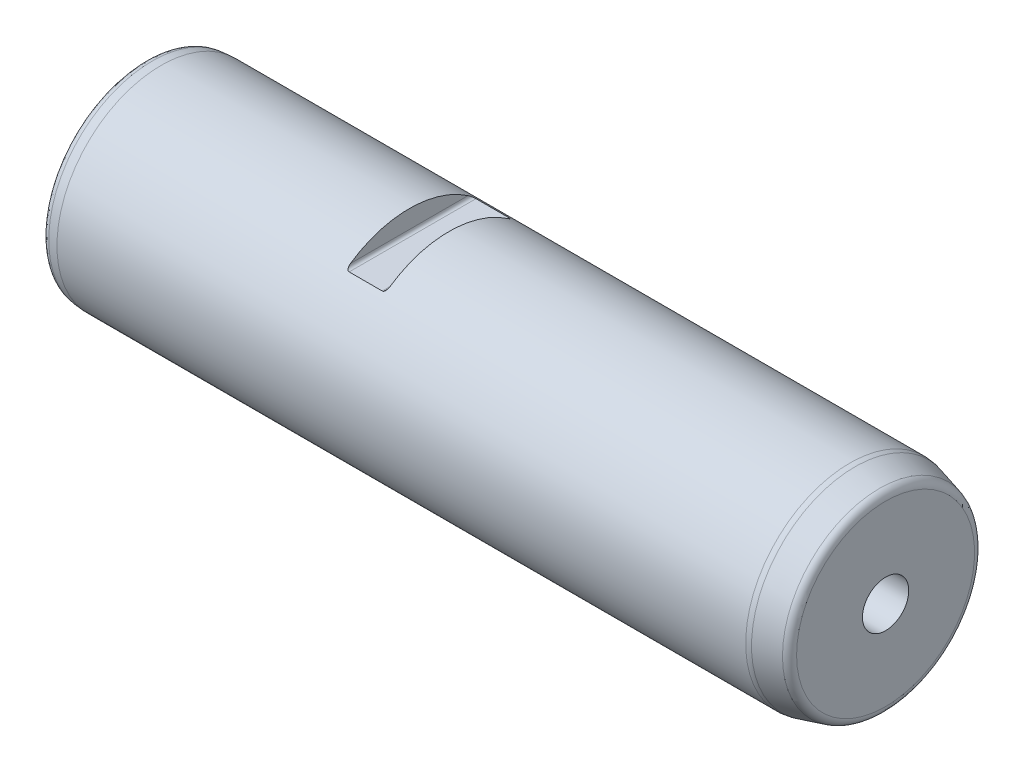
ISO-10303-21;
HEADER;
FILE_DESCRIPTION(('STEP AP214'),'2;1');
FILE_NAME('part.step','',(''),(''),'','','');
FILE_SCHEMA(('AUTOMOTIVE_DESIGN { 1 0 10303 214 1 1 1 1 }'));
ENDSEC;
DATA;
#1=APPLICATION_CONTEXT('core data for automotive mechanical design processes');
#2=APPLICATION_PROTOCOL_DEFINITION('international standard','automotive_design',2000,#1);
#3=PRODUCT_CONTEXT('',#1,'mechanical');
#4=PRODUCT('Part','Part','',(#3));
#5=PRODUCT_RELATED_PRODUCT_CATEGORY('part','',(#4));
#6=PRODUCT_DEFINITION_FORMATION('','',#4);
#7=PRODUCT_DEFINITION_CONTEXT('part definition',#1,'design');
#8=PRODUCT_DEFINITION('design','',#6,#7);
#9=PRODUCT_DEFINITION_SHAPE('','',#8);
#10=(LENGTH_UNIT() NAMED_UNIT(*) SI_UNIT(.MILLI.,.METRE.));
#11=(NAMED_UNIT(*) PLANE_ANGLE_UNIT() SI_UNIT($,.RADIAN.));
#12=(NAMED_UNIT(*) SI_UNIT($,.STERADIAN.) SOLID_ANGLE_UNIT());
#13=UNCERTAINTY_MEASURE_WITH_UNIT(LENGTH_MEASURE(1.E-05),#10,'distance_accuracy_value','');
#14=(GEOMETRIC_REPRESENTATION_CONTEXT(3) GLOBAL_UNCERTAINTY_ASSIGNED_CONTEXT((#13)) GLOBAL_UNIT_ASSIGNED_CONTEXT((#10,
#11,#12)) REPRESENTATION_CONTEXT('',''));
#15=CARTESIAN_POINT('',(0.,0.,0.));
#16=DIRECTION('',(0.,0.,1.));
#17=DIRECTION('',(1.,0.,0.));
#18=AXIS2_PLACEMENT_3D('',#15,#16,#17);
#19=CARTESIAN_POINT('',(0.,0.,0.));
#20=DIRECTION('',(1.,0.,0.));
#21=DIRECTION('',(0.,0.,-1.));
#22=AXIS2_PLACEMENT_3D('',#19,#20,#21);
#23=PLANE('',#22);
#24=CARTESIAN_POINT('',(0.,0.,0.));
#25=DIRECTION('',(1.,0.,0.));
#26=DIRECTION('',(0.,0.,-1.));
#27=AXIS2_PLACEMENT_3D('',#24,#25,#26);
#28=CIRCLE('',#27,28.771728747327);
#29=CARTESIAN_POINT('',(0.,0.,-28.771728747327));
#30=VERTEX_POINT('',#29);
#31=EDGE_CURVE('E160',#30,#30,#28,.F.);
#32=ORIENTED_EDGE('',*,*,#31,.T.);
#33=EDGE_LOOP('',(#32));
#34=FACE_BOUND('',#33,.T.);
#35=ADVANCED_FACE('F15',(#34),#23,.F.);
#36=CARTESIAN_POINT('',(0.,0.,0.));
#37=DIRECTION('',(-1.,0.,0.));
#38=DIRECTION('',(0.,0.,1.));
#39=AXIS2_PLACEMENT_3D('',#36,#37,#38);
#40=CYLINDRICAL_SURFACE('',#39,31.5);
#41=CARTESIAN_POINT('',(91.,25.,-19.1637678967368));
#42=CARTESIAN_POINT('',(91.0206021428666,24.9999962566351,-19.1637724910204));
#43=CARTESIAN_POINT('',(91.0411895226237,25.000637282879,-19.1629365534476));
#44=CARTESIAN_POINT('',(91.0821323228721,25.0031684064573,-19.1596340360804));
#45=CARTESIAN_POINT('',(91.1024879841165,25.0050570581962,-19.1571693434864));
#46=CARTESIAN_POINT('',(91.1624864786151,25.0124756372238,-19.1474836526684));
#47=CARTESIAN_POINT('',(91.2015690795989,25.0197603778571,-19.1379682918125));
#48=CARTESIAN_POINT('',(91.2768030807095,25.0382921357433,-19.1137163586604));
#49=CARTESIAN_POINT('',(91.3129662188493,25.0495222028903,-19.0990021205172));
#50=CARTESIAN_POINT('',(91.3821411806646,25.0751576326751,-19.0653329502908));
#51=CARTESIAN_POINT('',(91.4151429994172,25.0895726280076,-19.0463651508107));
#52=CARTESIAN_POINT('',(91.4940924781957,25.1289598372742,-18.9943915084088));
#53=CARTESIAN_POINT('',(91.5378167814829,25.1555174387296,-18.9592231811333));
#54=CARTESIAN_POINT('',(91.6178752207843,25.2121909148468,-18.8837940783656));
#55=CARTESIAN_POINT('',(91.654194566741,25.2423137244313,-18.8435233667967));
#56=CARTESIAN_POINT('',(91.7400427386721,25.323512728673,-18.7343708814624));
#57=CARTESIAN_POINT('',(91.7844613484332,25.3763362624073,-18.6627946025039));
#58=CARTESIAN_POINT('',(91.8595737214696,25.4847393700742,-18.5144966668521));
#59=CARTESIAN_POINT('',(91.8902090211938,25.5403295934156,-18.4377546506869));
#60=CARTESIAN_POINT('',(91.9297784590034,25.6300581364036,-18.3126586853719));
#61=CARTESIAN_POINT('',(91.9424916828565,25.6638849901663,-18.2652250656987));
#62=CARTESIAN_POINT('',(91.9639933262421,25.7317021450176,-18.1695608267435));
#63=CARTESIAN_POINT('',(91.9727802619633,25.7656925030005,-18.121329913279));
#64=CARTESIAN_POINT('',(91.9865826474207,25.8331875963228,-18.0249779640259));
#65=CARTESIAN_POINT('',(91.9916469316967,25.8666927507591,-17.9768640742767));
#66=CARTESIAN_POINT('',(91.9983485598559,25.9335124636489,-17.8803351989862));
#67=CARTESIAN_POINT('',(91.9999892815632,25.9668271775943,-17.8319205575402));
#68=CARTESIAN_POINT('',(92.,26.,-17.7834192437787));
#69=B_SPLINE_CURVE_WITH_KNOTS('',3,(#41,#42,#43,#44,#45,#46,#47,#48,#49,#50,#51,#52,#53,#54,#55,
#56,#57,#58,#59,#60,#61,#62,#63,#64,#65,#66,#67,#68),.UNSPECIFIED.,.F.,.F.,(4,2,2,2,2,2,2,2,2,2,
2,2,2,4),(0.,0.061752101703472,0.123432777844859,0.245296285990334,0.366642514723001,
0.488360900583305,0.673551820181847,0.859109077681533,1.1557616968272,1.45366100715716,
1.63242917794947,1.81126485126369,1.9877104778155,2.16398193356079),.UNSPECIFIED.);
#70=CARTESIAN_POINT('',(91.,25.,-19.1637678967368));
#71=VERTEX_POINT('',#70);
#72=CARTESIAN_POINT('',(92.,26.,-17.7834192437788));
#73=VERTEX_POINT('',#72);
#74=EDGE_CURVE('E206',#71,#73,#69,.T.);
#75=ORIENTED_EDGE('',*,*,#74,.T.);
#76=CARTESIAN_POINT('',(92.,0.,0.));
#77=DIRECTION('',(1.,0.,0.));
#78=DIRECTION('',(0.,0.,-1.));
#79=AXIS2_PLACEMENT_3D('',#76,#77,#78);
#80=CIRCLE('',#79,31.5);
#81=CARTESIAN_POINT('',(92.,26.,17.7834192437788));
#82=VERTEX_POINT('',#81);
#83=EDGE_CURVE('E9',#73,#82,#80,.T.);
#84=ORIENTED_EDGE('',*,*,#83,.T.);
#85=CARTESIAN_POINT('',(92.,26.,17.7834192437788));
#86=CARTESIAN_POINT('',(91.9999572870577,25.9536837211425,17.8511416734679));
#87=CARTESIAN_POINT('',(91.9967773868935,25.9070697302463,17.9187190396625));
#88=CARTESIAN_POINT('',(91.98359435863,25.8134163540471,18.0533717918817));
#89=CARTESIAN_POINT('',(91.9735592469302,25.7663759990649,18.1204433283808));
#90=CARTESIAN_POINT('',(91.9459716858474,25.672018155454,18.2538828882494));
#91=CARTESIAN_POINT('',(91.9283458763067,25.6247025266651,18.3202373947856));
#92=CARTESIAN_POINT('',(91.8846961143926,25.5309760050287,18.450628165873));
#93=CARTESIAN_POINT('',(91.8586908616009,25.4845633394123,18.5146692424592));
#94=CARTESIAN_POINT('',(91.8035708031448,25.4032208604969,18.6260588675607));
#95=CARTESIAN_POINT('',(91.7762945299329,25.3679487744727,18.6740601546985));
#96=CARTESIAN_POINT('',(91.7149053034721,25.2992635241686,18.7670081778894));
#97=CARTESIAN_POINT('',(91.6807928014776,25.2658502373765,18.8119551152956));
#98=CARTESIAN_POINT('',(91.6042482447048,25.2016125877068,18.8979268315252));
#99=CARTESIAN_POINT('',(91.5617053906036,25.1708315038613,18.9388871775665));
#100=CARTESIAN_POINT('',(91.4677411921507,25.1144557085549,19.0135816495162));
#101=CARTESIAN_POINT('',(91.4163575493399,25.0888399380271,19.0473451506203));
#102=CARTESIAN_POINT('',(91.3286773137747,25.0549354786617,19.0918997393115));
#103=CARTESIAN_POINT('',(91.2952896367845,25.0439158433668,19.106347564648));
#104=CARTESIAN_POINT('',(91.2260723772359,25.0252341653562,19.1308099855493));
#105=CARTESIAN_POINT('',(91.1902489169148,25.0175640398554,19.1408352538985));
#106=CARTESIAN_POINT('',(91.1285741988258,25.0079765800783,19.1533587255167));
#107=CARTESIAN_POINT('',(91.1031595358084,25.0050065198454,19.1572353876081));
#108=CARTESIAN_POINT('',(91.0518392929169,25.001008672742,19.1624520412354));
#109=CARTESIAN_POINT('',(91.0259323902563,24.9999872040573,19.1637837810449));
#110=CARTESIAN_POINT('',(91.,25.,19.1637678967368));
#111=B_SPLINE_CURVE_WITH_KNOTS('',3,(#85,#86,#87,#88,#89,#90,#91,#92,#93,#94,#95,#96,#97,#98,
#99,#100,#101,#102,#103,#104,#105,#106,#107,#108,#109,#110),.UNSPECIFIED.,.F.,.F.,(4,2,2,2,2,2,
2,2,2,2,2,2,4),(0.,0.246152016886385,0.493460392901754,0.743214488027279,0.992415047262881,
1.18859975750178,1.38477152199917,1.58371665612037,1.78183351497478,1.89547599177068,
2.00884269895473,2.08629068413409,2.16398936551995),.UNSPECIFIED.);
#112=CARTESIAN_POINT('',(91.,25.,19.1637678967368));
#113=VERTEX_POINT('',#112);
#114=EDGE_CURVE('E23',#82,#113,#111,.T.);
#115=ORIENTED_EDGE('',*,*,#114,.T.);
#116=DIRECTION('',(-1.,0.,0.));
#117=VECTOR('',#116,1.);
#118=CARTESIAN_POINT('',(0.,25.,19.1637678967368));
#119=LINE('',#118,#117);
#120=CARTESIAN_POINT('',(81.,25.,19.1637678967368));
#121=VERTEX_POINT('',#120);
#122=EDGE_CURVE('E74',#113,#121,#119,.T.);
#123=ORIENTED_EDGE('',*,*,#122,.T.);
#124=CARTESIAN_POINT('',(81.,25.,19.1637678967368));
#125=CARTESIAN_POINT('',(80.9793978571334,24.9999962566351,19.1637724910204));
#126=CARTESIAN_POINT('',(80.9588104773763,25.000637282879,19.1629365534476));
#127=CARTESIAN_POINT('',(80.9178676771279,25.0031684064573,19.1596340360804));
#128=CARTESIAN_POINT('',(80.8975120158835,25.0050570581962,19.1571693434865));
#129=CARTESIAN_POINT('',(80.8375135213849,25.0124756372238,19.1474836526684));
#130=CARTESIAN_POINT('',(80.7984309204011,25.0197603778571,19.1379682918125));
#131=CARTESIAN_POINT('',(80.7231969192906,25.0382921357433,19.1137163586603));
#132=CARTESIAN_POINT('',(80.6870337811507,25.0495222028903,19.0990021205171));
#133=CARTESIAN_POINT('',(80.6178588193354,25.0751576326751,19.0653329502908));
#134=CARTESIAN_POINT('',(80.5848570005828,25.0895726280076,19.0463651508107));
#135=CARTESIAN_POINT('',(80.5059075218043,25.1289598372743,18.9943915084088));
#136=CARTESIAN_POINT('',(80.4621832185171,25.1555174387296,18.9592231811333));
#137=CARTESIAN_POINT('',(80.3821247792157,25.2121909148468,18.8837940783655));
#138=CARTESIAN_POINT('',(80.345805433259,25.2423137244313,18.8435233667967));
#139=CARTESIAN_POINT('',(80.2599572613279,25.3235127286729,18.7343708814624));
#140=CARTESIAN_POINT('',(80.2155386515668,25.3763362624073,18.662794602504));
#141=CARTESIAN_POINT('',(80.1404262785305,25.4847393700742,18.5144966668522));
#142=CARTESIAN_POINT('',(80.1097909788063,25.5403295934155,18.437754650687));
#143=CARTESIAN_POINT('',(80.0702215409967,25.6300581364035,18.3126586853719));
#144=CARTESIAN_POINT('',(80.0575083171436,25.6638849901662,18.2652250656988));
#145=CARTESIAN_POINT('',(80.0360066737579,25.7317021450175,18.1695608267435));
#146=CARTESIAN_POINT('',(80.0272197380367,25.7656925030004,18.121329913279));
#147=CARTESIAN_POINT('',(80.0134173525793,25.8331875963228,18.0249779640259));
#148=CARTESIAN_POINT('',(80.0083530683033,25.866692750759,17.9768640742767));
#149=CARTESIAN_POINT('',(80.0016514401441,25.9335124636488,17.8803351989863));
#150=CARTESIAN_POINT('',(80.0000107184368,25.9668271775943,17.8319205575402));
#151=CARTESIAN_POINT('',(80.,26.,17.7834192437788));
#152=B_SPLINE_CURVE_WITH_KNOTS('',3,(#124,#125,#126,#127,#128,#129,#130,#131,#132,#133,#134,
#135,#136,#137,#138,#139,#140,#141,#142,#143,#144,#145,#146,#147,#148,#149,#150,#151),
.UNSPECIFIED.,.F.,.F.,(4,2,2,2,2,2,2,2,2,2,2,2,2,4),(0.,0.0617521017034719,0.123432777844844,
0.245296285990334,0.366642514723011,0.488360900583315,0.673551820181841,0.859109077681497,
1.15576169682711,1.45366100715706,1.63242917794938,1.81126485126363,1.98771047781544,
2.16398193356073),.UNSPECIFIED.);
#153=CARTESIAN_POINT('',(80.,26.,17.7834192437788));
#154=VERTEX_POINT('',#153);
#155=EDGE_CURVE('E65',#121,#154,#152,.T.);
#156=ORIENTED_EDGE('',*,*,#155,.T.);
#157=CARTESIAN_POINT('',(80.,0.,0.));
#158=DIRECTION('',(-1.,0.,0.));
#159=DIRECTION('',(0.,-1.,0.));
#160=AXIS2_PLACEMENT_3D('',#157,#158,#159);
#161=CIRCLE('',#160,31.5);
#162=CARTESIAN_POINT('',(80.,26.,-17.7834192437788));
#163=VERTEX_POINT('',#162);
#164=EDGE_CURVE('E54',#154,#163,#161,.T.);
#165=ORIENTED_EDGE('',*,*,#164,.T.);
#166=CARTESIAN_POINT('',(80.,26.,-17.7834192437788));
#167=CARTESIAN_POINT('',(80.0000427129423,25.9536837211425,-17.8511416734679));
#168=CARTESIAN_POINT('',(80.0032226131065,25.9070697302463,-17.9187190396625));
#169=CARTESIAN_POINT('',(80.01640564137,25.8134163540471,-18.0533717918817));
#170=CARTESIAN_POINT('',(80.0264407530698,25.7663759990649,-18.1204433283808));
#171=CARTESIAN_POINT('',(80.0540283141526,25.672018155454,-18.2538828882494));
#172=CARTESIAN_POINT('',(80.0716541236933,25.6247025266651,-18.3202373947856));
#173=CARTESIAN_POINT('',(80.1153038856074,25.5309760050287,-18.450628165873));
#174=CARTESIAN_POINT('',(80.1413091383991,25.4845633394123,-18.5146692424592));
#175=CARTESIAN_POINT('',(80.1964291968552,25.4032208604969,-18.6260588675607));
#176=CARTESIAN_POINT('',(80.2237054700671,25.3679487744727,-18.6740601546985));
#177=CARTESIAN_POINT('',(80.2850946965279,25.2992635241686,-18.7670081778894));
#178=CARTESIAN_POINT('',(80.3192071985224,25.2658502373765,-18.8119551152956));
#179=CARTESIAN_POINT('',(80.3957517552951,25.2016125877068,-18.8979268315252));
#180=CARTESIAN_POINT('',(80.4382946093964,25.1708315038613,-18.9388871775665));
#181=CARTESIAN_POINT('',(80.5322588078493,25.1144557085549,-19.0135816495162));
#182=CARTESIAN_POINT('',(80.5836424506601,25.0888399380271,-19.0473451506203));
#183=CARTESIAN_POINT('',(80.6713226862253,25.0549354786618,-19.0918997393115));
#184=CARTESIAN_POINT('',(80.7047103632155,25.0439158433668,-19.106347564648));
#185=CARTESIAN_POINT('',(80.7739276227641,25.0252341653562,-19.1308099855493));
#186=CARTESIAN_POINT('',(80.8097510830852,25.0175640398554,-19.1408352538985));
#187=CARTESIAN_POINT('',(80.8714258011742,25.0079765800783,-19.1533587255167));
#188=CARTESIAN_POINT('',(80.8968404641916,25.0050065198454,-19.1572353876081));
#189=CARTESIAN_POINT('',(80.9481607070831,25.001008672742,-19.1624520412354));
#190=CARTESIAN_POINT('',(80.9740676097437,24.9999872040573,-19.1637837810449));
#191=CARTESIAN_POINT('',(81.,25.,-19.1637678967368));
#192=B_SPLINE_CURVE_WITH_KNOTS('',3,(#166,#167,#168,#169,#170,#171,#172,#173,#174,#175,#176,
#177,#178,#179,#180,#181,#182,#183,#184,#185,#186,#187,#188,#189,#190,#191),.UNSPECIFIED.,.F.,
.F.,(4,2,2,2,2,2,2,2,2,2,2,2,4),(0.,0.246152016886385,0.493460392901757,0.743214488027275,
0.992415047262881,1.18859975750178,1.38477152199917,1.58371665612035,1.78183351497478,
1.89547599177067,2.00884269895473,2.08629068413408,2.16398936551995),.UNSPECIFIED.);
#193=CARTESIAN_POINT('',(81.,25.,-19.1637678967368));
#194=VERTEX_POINT('',#193);
#195=EDGE_CURVE('E59',#163,#194,#192,.T.);
#196=ORIENTED_EDGE('',*,*,#195,.T.);
#197=DIRECTION('',(-1.,0.,0.));
#198=VECTOR('',#197,1.);
#199=CARTESIAN_POINT('',(0.,25.,-19.1637678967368));
#200=LINE('',#199,#198);
#201=EDGE_CURVE('E75',#194,#71,#200,.F.);
#202=ORIENTED_EDGE('',*,*,#201,.T.);
#203=EDGE_LOOP('',(#75,#84,#115,#123,#156,#165,#196,#202));
#204=FACE_BOUND('',#203,.T.);
#205=CARTESIAN_POINT('',(4.99999999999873,0.,0.));
#206=DIRECTION('',(1.,0.,0.));
#207=DIRECTION('',(0.,0.,-1.));
#208=AXIS2_PLACEMENT_3D('',#205,#206,#207);
#209=CIRCLE('',#208,31.5);
#210=CARTESIAN_POINT('',(4.99999999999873,0.,-31.5));
#211=VERTEX_POINT('',#210);
#212=EDGE_CURVE('E159',#211,#211,#209,.T.);
#213=ORIENTED_EDGE('',*,*,#212,.T.);
#214=EDGE_LOOP('',(#213));
#215=FACE_BOUND('',#214,.T.);
#216=CARTESIAN_POINT('',(213.210085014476,0.,0.));
#217=DIRECTION('',(1.,0.,0.));
#218=DIRECTION('',(0.,0.,-1.));
#219=AXIS2_PLACEMENT_3D('',#216,#217,#218);
#220=CIRCLE('',#219,31.5);
#221=CARTESIAN_POINT('',(213.210085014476,0.,-31.5));
#222=VERTEX_POINT('',#221);
#223=EDGE_CURVE('E177',#222,#222,#220,.F.);
#224=ORIENTED_EDGE('',*,*,#223,.T.);
#225=EDGE_LOOP('',(#224));
#226=FACE_BOUND('',#225,.T.);
#227=ADVANCED_FACE('F71',(#204,#215,#226),#40,.T.);
#228=CARTESIAN_POINT('',(224.,0.,0.));
#229=DIRECTION('',(-1.,0.,0.));
#230=DIRECTION('',(0.,0.,1.));
#231=AXIS2_PLACEMENT_3D('',#228,#229,#230);
#232=CONICAL_SURFACE('',#231,28.8205080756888,0.26179938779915);
#233=CARTESIAN_POINT('',(222.147047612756,0.,0.));
#234=DIRECTION('',(1.,0.,0.));
#235=DIRECTION('',(0.,0.,-1.));
#236=AXIS2_PLACEMENT_3D('',#233,#234,#235);
#237=CIRCLE('',#236,29.317005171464);
#238=CARTESIAN_POINT('',(222.147047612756,0.,-29.317005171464));
#239=VERTEX_POINT('',#238);
#240=EDGE_CURVE('E165',#239,#239,#237,.F.);
#241=ORIENTED_EDGE('',*,*,#240,.T.);
#242=EDGE_LOOP('',(#241));
#243=FACE_BOUND('',#242,.T.);
#244=CARTESIAN_POINT('',(214.762999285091,0.,0.));
#245=DIRECTION('',(1.,0.,0.));
#246=DIRECTION('',(0.,0.,-1.));
#247=AXIS2_PLACEMENT_3D('',#244,#245,#246);
#248=CIRCLE('',#247,31.2955549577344);
#249=CARTESIAN_POINT('',(214.762999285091,0.,-31.2955549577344));
#250=VERTEX_POINT('',#249);
#251=EDGE_CURVE('E190',#250,#250,#248,.T.);
#252=ORIENTED_EDGE('',*,*,#251,.T.);
#253=EDGE_LOOP('',(#252));
#254=FACE_BOUND('',#253,.T.);
#255=ADVANCED_FACE('F122',(#243,#254),#232,.T.);
#256=CARTESIAN_POINT('',(224.,28.8205080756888,0.));
#257=DIRECTION('',(-1.,0.,0.));
#258=DIRECTION('',(0.,0.,1.));
#259=AXIS2_PLACEMENT_3D('',#256,#257,#258);
#260=PLANE('',#259);
#261=CARTESIAN_POINT('',(224.,0.,0.));
#262=DIRECTION('',(1.,0.,0.));
#263=DIRECTION('',(0.,0.,-1.));
#264=AXIS2_PLACEMENT_3D('',#261,#262,#263);
#265=CIRCLE('',#264,7.);
#266=CARTESIAN_POINT('',(224.,0.,-7.));
#267=VERTEX_POINT('',#266);
#268=EDGE_CURVE('E180',#267,#267,#265,.T.);
#269=ORIENTED_EDGE('',*,*,#268,.F.);
#270=EDGE_LOOP('',(#269));
#271=FACE_BOUND('',#270,.T.);
#272=CARTESIAN_POINT('',(224.,0.,0.));
#273=DIRECTION('',(-1.,0.,0.));
#274=DIRECTION('',(0.,0.,1.));
#275=AXIS2_PLACEMENT_3D('',#272,#273,#274);
#276=CIRCLE('',#275,26.9021906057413);
#277=CARTESIAN_POINT('',(224.,0.,26.9021906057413));
#278=VERTEX_POINT('',#277);
#279=EDGE_CURVE('E161',#278,#278,#276,.F.);
#280=ORIENTED_EDGE('',*,*,#279,.T.);
#281=EDGE_LOOP('',(#280));
#282=FACE_BOUND('',#281,.T.);
#283=ADVANCED_FACE('F119',(#271,#282),#260,.F.);
#284=CARTESIAN_POINT('',(213.210085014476,0.,0.));
#285=DIRECTION('',(1.,0.,0.));
#286=DIRECTION('',(0.,0.,-1.));
#287=AXIS2_PLACEMENT_3D('',#284,#285,#286);
#288=TOROIDAL_SURFACE('',#287,25.5,6.);
#289=ORIENTED_EDGE('',*,*,#251,.F.);
#290=EDGE_LOOP('',(#289));
#291=FACE_BOUND('',#290,.T.);
#292=ORIENTED_EDGE('',*,*,#223,.F.);
#293=EDGE_LOOP('',(#292));
#294=FACE_BOUND('',#293,.T.);
#295=ADVANCED_FACE('F121',(#291,#294),#288,.T.);
#296=CARTESIAN_POINT('',(221.5,0.,0.));
#297=DIRECTION('',(-1.,0.,0.));
#298=DIRECTION('',(0.,0.,1.));
#299=AXIS2_PLACEMENT_3D('',#296,#297,#298);
#300=TOROIDAL_SURFACE('',#299,26.9021906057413,2.5);
#301=ORIENTED_EDGE('',*,*,#279,.F.);
#302=EDGE_LOOP('',(#301));
#303=FACE_BOUND('',#302,.T.);
#304=ORIENTED_EDGE('',*,*,#240,.F.);
#305=EDGE_LOOP('',(#304));
#306=FACE_BOUND('',#305,.T.);
#307=ADVANCED_FACE('F142',(#303,#306),#300,.T.);
#308=CARTESIAN_POINT('',(0.,0.,0.));
#309=DIRECTION('',(1.,0.,0.));
#310=DIRECTION('',(0.,0.,-1.));
#311=AXIS2_PLACEMENT_3D('',#308,#309,#310);
#312=CONICAL_SURFACE('',#311,31.0625566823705,0.0872664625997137);
#313=CARTESIAN_POINT('',(2.28211064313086,0.,0.));
#314=DIRECTION('',(1.,0.,0.));
#315=DIRECTION('',(0.,0.,-1.));
#316=AXIS2_PLACEMENT_3D('',#313,#314,#315);
#317=CIRCLE('',#316,31.2622154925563);
#318=CARTESIAN_POINT('',(2.28211064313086,0.,-31.2622154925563));
#319=VERTEX_POINT('',#318);
#320=EDGE_CURVE('E60',#319,#319,#317,.T.);
#321=ORIENTED_EDGE('',*,*,#320,.T.);
#322=EDGE_LOOP('',(#321));
#323=FACE_BOUND('',#322,.T.);
#324=ORIENTED_EDGE('',*,*,#212,.F.);
#325=EDGE_LOOP('',(#324));
#326=FACE_BOUND('',#325,.T.);
#327=ADVANCED_FACE('F145',(#323,#326),#312,.T.);
#328=CARTESIAN_POINT('',(2.5,0.,0.));
#329=DIRECTION('',(1.,0.,0.));
#330=DIRECTION('',(0.,0.,-1.));
#331=AXIS2_PLACEMENT_3D('',#328,#329,#330);
#332=TOROIDAL_SURFACE('',#331,28.771728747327,2.5);
#333=ORIENTED_EDGE('',*,*,#320,.F.);
#334=EDGE_LOOP('',(#333));
#335=FACE_BOUND('',#334,.T.);
#336=ORIENTED_EDGE('',*,*,#31,.F.);
#337=EDGE_LOOP('',(#336));
#338=FACE_BOUND('',#337,.T.);
#339=ADVANCED_FACE('F17',(#335,#338),#332,.T.);
#340=CARTESIAN_POINT('',(200.,0.,0.));
#341=DIRECTION('',(1.,0.,0.));
#342=DIRECTION('',(0.,0.,-1.));
#343=AXIS2_PLACEMENT_3D('',#340,#341,#342);
#344=PLANE('',#343);
#345=CARTESIAN_POINT('',(200.,0.,0.));
#346=DIRECTION('',(1.,0.,0.));
#347=DIRECTION('',(0.,0.,-1.));
#348=AXIS2_PLACEMENT_3D('',#345,#346,#347);
#349=CIRCLE('',#348,7.);
#350=CARTESIAN_POINT('',(200.,0.,-7.));
#351=VERTEX_POINT('',#350);
#352=EDGE_CURVE('E173',#351,#351,#349,.T.);
#353=ORIENTED_EDGE('',*,*,#352,.T.);
#354=EDGE_LOOP('',(#353));
#355=FACE_BOUND('',#354,.T.);
#356=CARTESIAN_POINT('',(200.,0.,0.));
#357=DIRECTION('',(1.,0.,0.));
#358=DIRECTION('',(0.,0.,-1.));
#359=AXIS2_PLACEMENT_3D('',#356,#357,#358);
#360=CIRCLE('',#359,5.1);
#361=CARTESIAN_POINT('',(200.,0.,-5.1));
#362=VERTEX_POINT('',#361);
#363=EDGE_CURVE('E170',#362,#362,#360,.F.);
#364=ORIENTED_EDGE('',*,*,#363,.T.);
#365=EDGE_LOOP('',(#364));
#366=FACE_BOUND('',#365,.T.);
#367=ADVANCED_FACE('F103',(#355,#366),#344,.T.);
#368=CARTESIAN_POINT('',(200.,0.,0.));
#369=DIRECTION('',(1.,0.,0.));
#370=DIRECTION('',(0.,0.,-1.));
#371=AXIS2_PLACEMENT_3D('',#368,#369,#370);
#372=CYLINDRICAL_SURFACE('',#371,7.);
#373=ORIENTED_EDGE('',*,*,#352,.F.);
#374=EDGE_LOOP('',(#373));
#375=FACE_BOUND('',#374,.T.);
#376=ORIENTED_EDGE('',*,*,#268,.T.);
#377=EDGE_LOOP('',(#376));
#378=FACE_BOUND('',#377,.T.);
#379=ADVANCED_FACE('F106',(#375,#378),#372,.F.);
#380=CARTESIAN_POINT('',(194.,0.,0.));
#381=DIRECTION('',(1.,0.,0.));
#382=DIRECTION('',(0.,0.,-1.));
#383=AXIS2_PLACEMENT_3D('',#380,#381,#382);
#384=CONICAL_SURFACE('',#383,5.1,1.0471975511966);
#385=CARTESIAN_POINT('',(191.055513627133,0.,0.));
#386=VERTEX_POINT('',#385);
#387=VERTEX_LOOP('',#386);
#388=FACE_BOUND('',#387,.T.);
#389=CARTESIAN_POINT('',(194.,0.,0.));
#390=DIRECTION('',(1.,0.,0.));
#391=DIRECTION('',(0.,0.,-1.));
#392=AXIS2_PLACEMENT_3D('',#389,#390,#391);
#393=CIRCLE('',#392,5.1);
#394=CARTESIAN_POINT('',(194.,0.,-5.1));
#395=VERTEX_POINT('',#394);
#396=EDGE_CURVE('E172',#395,#395,#393,.T.);
#397=ORIENTED_EDGE('',*,*,#396,.T.);
#398=EDGE_LOOP('',(#397));
#399=FACE_BOUND('',#398,.T.);
#400=ADVANCED_FACE('F110',(#388,#399),#384,.F.);
#401=CARTESIAN_POINT('',(224.,0.,0.));
#402=DIRECTION('',(1.,0.,0.));
#403=DIRECTION('',(0.,0.,-1.));
#404=AXIS2_PLACEMENT_3D('',#401,#402,#403);
#405=CYLINDRICAL_SURFACE('',#404,5.1);
#406=ORIENTED_EDGE('',*,*,#396,.F.);
#407=EDGE_LOOP('',(#406));
#408=FACE_BOUND('',#407,.T.);
#409=ORIENTED_EDGE('',*,*,#363,.F.);
#410=EDGE_LOOP('',(#409));
#411=FACE_BOUND('',#410,.T.);
#412=ADVANCED_FACE('F112',(#408,#411),#405,.F.);
#413=CARTESIAN_POINT('',(92.,26.,-31.5));
#414=DIRECTION('',(1.,0.,0.));
#415=DIRECTION('',(0.,0.,-1.));
#416=AXIS2_PLACEMENT_3D('',#413,#414,#415);
#417=PLANE('',#416);
#418=DIRECTION('',(0.,0.,1.));
#419=VECTOR('',#418,1.);
#420=CARTESIAN_POINT('',(92.,26.,-31.5));
#421=LINE('',#420,#419);
#422=EDGE_CURVE('E184',#73,#82,#421,.T.);
#423=ORIENTED_EDGE('',*,*,#422,.T.);
#424=ORIENTED_EDGE('',*,*,#83,.F.);
#425=EDGE_LOOP('',(#423,#424));
#426=FACE_BOUND('',#425,.T.);
#427=ADVANCED_FACE('F115',(#426),#417,.F.);
#428=CARTESIAN_POINT('',(91.,26.,-31.5));
#429=DIRECTION('',(0.,0.,1.));
#430=DIRECTION('',(1.,0.,0.));
#431=AXIS2_PLACEMENT_3D('',#428,#429,#430);
#432=CYLINDRICAL_SURFACE('',#431,1.);
#433=ORIENTED_EDGE('',*,*,#422,.F.);
#434=ORIENTED_EDGE('',*,*,#74,.F.);
#435=DIRECTION('',(0.,0.,1.));
#436=VECTOR('',#435,1.);
#437=CARTESIAN_POINT('',(91.,25.,-31.5));
#438=LINE('',#437,#436);
#439=EDGE_CURVE('E199',#71,#113,#438,.T.);
#440=ORIENTED_EDGE('',*,*,#439,.T.);
#441=ORIENTED_EDGE('',*,*,#114,.F.);
#442=EDGE_LOOP('',(#433,#434,#440,#441));
#443=FACE_BOUND('',#442,.T.);
#444=ADVANCED_FACE('F217',(#443),#432,.F.);
#445=CARTESIAN_POINT('',(81.,25.,-31.5));
#446=DIRECTION('',(0.,-1.,0.));
#447=DIRECTION('',(0.,0.,-1.));
#448=AXIS2_PLACEMENT_3D('',#445,#446,#447);
#449=PLANE('',#448);
#450=ORIENTED_EDGE('',*,*,#439,.F.);
#451=ORIENTED_EDGE('',*,*,#201,.F.);
#452=DIRECTION('',(0.,0.,1.));
#453=VECTOR('',#452,1.);
#454=CARTESIAN_POINT('',(81.,25.,-31.5));
#455=LINE('',#454,#453);
#456=EDGE_CURVE('E67',#194,#121,#455,.T.);
#457=ORIENTED_EDGE('',*,*,#456,.T.);
#458=ORIENTED_EDGE('',*,*,#122,.F.);
#459=EDGE_LOOP('',(#450,#451,#457,#458));
#460=FACE_BOUND('',#459,.T.);
#461=ADVANCED_FACE('F98',(#460),#449,.F.);
#462=CARTESIAN_POINT('',(81.,26.,-31.5));
#463=DIRECTION('',(0.,0.,1.));
#464=DIRECTION('',(1.,0.,0.));
#465=AXIS2_PLACEMENT_3D('',#462,#463,#464);
#466=CYLINDRICAL_SURFACE('',#465,1.);
#467=ORIENTED_EDGE('',*,*,#456,.F.);
#468=ORIENTED_EDGE('',*,*,#195,.F.);
#469=DIRECTION('',(0.,0.,1.));
#470=VECTOR('',#469,1.);
#471=CARTESIAN_POINT('',(80.,26.,-31.5));
#472=LINE('',#471,#470);
#473=EDGE_CURVE('E29',#163,#154,#472,.T.);
#474=ORIENTED_EDGE('',*,*,#473,.T.);
#475=ORIENTED_EDGE('',*,*,#155,.F.);
#476=EDGE_LOOP('',(#467,#468,#474,#475));
#477=FACE_BOUND('',#476,.T.);
#478=ADVANCED_FACE('F64',(#477),#466,.F.);
#479=CARTESIAN_POINT('',(80.,31.5,-31.5));
#480=DIRECTION('',(-1.,0.,0.));
#481=DIRECTION('',(0.,-1.,0.));
#482=AXIS2_PLACEMENT_3D('',#479,#480,#481);
#483=PLANE('',#482);
#484=ORIENTED_EDGE('',*,*,#473,.F.);
#485=ORIENTED_EDGE('',*,*,#164,.F.);
#486=EDGE_LOOP('',(#484,#485));
#487=FACE_BOUND('',#486,.T.);
#488=ADVANCED_FACE('F55',(#487),#483,.F.);
#489=CLOSED_SHELL('',(#35,#227,#255,#283,#295,#307,#327,#339,#367,#379,#400,#412,#427,#444,#461,
#478,#488));
#490=MANIFOLD_SOLID_BREP('B1',#489);
#491=ADVANCED_BREP_SHAPE_REPRESENTATION('',(#18,#490),#14);
#492=SHAPE_DEFINITION_REPRESENTATION(#9,#491);
ENDSEC;
END-ISO-10303-21;
